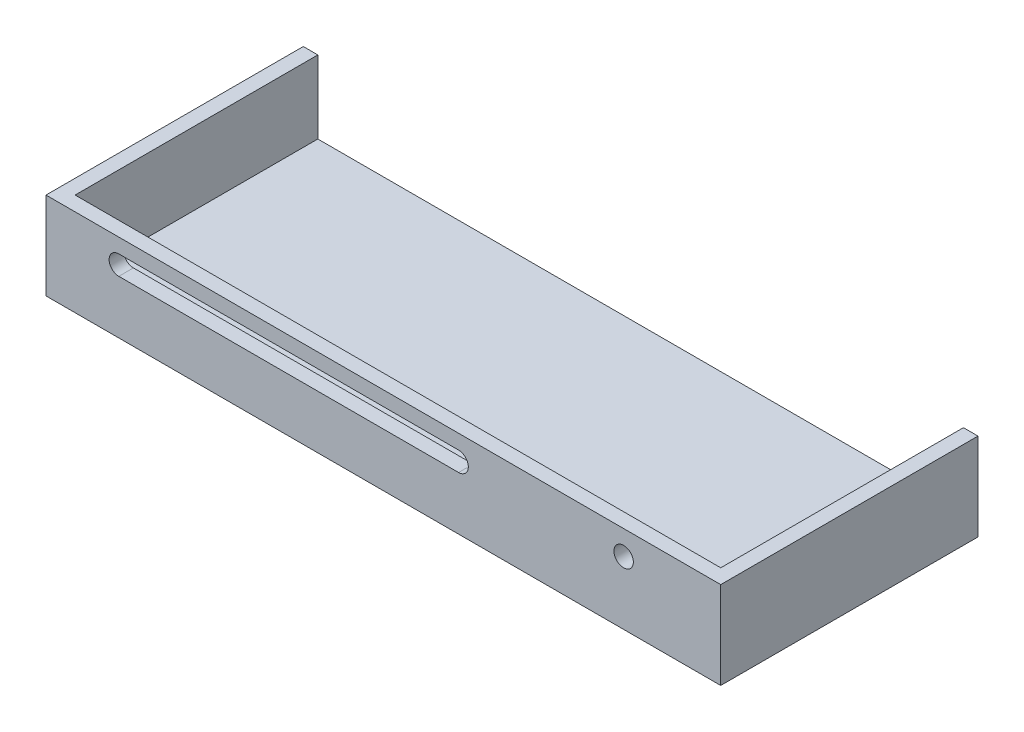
ISO-10303-21;
HEADER;
FILE_DESCRIPTION(('STEP AP214'),'2;1');
FILE_NAME('part.step','',(''),(''),'','','');
FILE_SCHEMA(('AUTOMOTIVE_DESIGN { 1 0 10303 214 1 1 1 1 }'));
ENDSEC;
DATA;
#1=APPLICATION_CONTEXT('core data for automotive mechanical design processes');
#2=APPLICATION_PROTOCOL_DEFINITION('international standard','automotive_design',2000,#1);
#3=PRODUCT_CONTEXT('',#1,'mechanical');
#4=PRODUCT('Part','Part','',(#3));
#5=PRODUCT_RELATED_PRODUCT_CATEGORY('part','',(#4));
#6=PRODUCT_DEFINITION_FORMATION('','',#4);
#7=PRODUCT_DEFINITION_CONTEXT('part definition',#1,'design');
#8=PRODUCT_DEFINITION('design','',#6,#7);
#9=PRODUCT_DEFINITION_SHAPE('','',#8);
#10=(LENGTH_UNIT() NAMED_UNIT(*) SI_UNIT(.MILLI.,.METRE.));
#11=(NAMED_UNIT(*) PLANE_ANGLE_UNIT() SI_UNIT($,.RADIAN.));
#12=(NAMED_UNIT(*) SI_UNIT($,.STERADIAN.) SOLID_ANGLE_UNIT());
#13=UNCERTAINTY_MEASURE_WITH_UNIT(LENGTH_MEASURE(1.E-05),#10,'distance_accuracy_value','');
#14=(GEOMETRIC_REPRESENTATION_CONTEXT(3) GLOBAL_UNCERTAINTY_ASSIGNED_CONTEXT((#13)) GLOBAL_UNIT_ASSIGNED_CONTEXT((#10,
#11,#12)) REPRESENTATION_CONTEXT('',''));
#15=CARTESIAN_POINT('',(0.,0.,0.));
#16=DIRECTION('',(0.,0.,1.));
#17=DIRECTION('',(1.,0.,0.));
#18=AXIS2_PLACEMENT_3D('',#15,#16,#17);
#19=CARTESIAN_POINT('',(139.,-3.,-15.1919082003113));
#20=DIRECTION('',(0.,0.,1.));
#21=DIRECTION('',(1.,0.,0.));
#22=AXIS2_PLACEMENT_3D('',#19,#20,#21);
#23=PLANE('',#22);
#24=DIRECTION('',(1.,0.,0.));
#25=VECTOR('',#24,1.);
#26=CARTESIAN_POINT('',(0.,17.,-15.1919082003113));
#27=LINE('',#26,#25);
#28=CARTESIAN_POINT('',(0.,17.,-15.1919082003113));
#29=VERTEX_POINT('',#28);
#30=CARTESIAN_POINT('',(139.,17.,-15.1919082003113));
#31=VERTEX_POINT('',#30);
#32=EDGE_CURVE('E136',#29,#31,#27,.T.);
#33=ORIENTED_EDGE('',*,*,#32,.F.);
#34=DIRECTION('',(0.,1.,0.));
#35=VECTOR('',#34,1.);
#36=CARTESIAN_POINT('',(0.,-3.,-15.1919082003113));
#37=LINE('',#36,#35);
#38=CARTESIAN_POINT('',(0.,35.,-15.1919082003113));
#39=VERTEX_POINT('',#38);
#40=EDGE_CURVE('E147',#29,#39,#37,.T.);
#41=ORIENTED_EDGE('',*,*,#40,.T.);
#42=DIRECTION('',(1.,0.,0.));
#43=VECTOR('',#42,1.);
#44=CARTESIAN_POINT('',(0.,35.,-15.1919082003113));
#45=LINE('',#44,#43);
#46=CARTESIAN_POINT('',(3.,35.,-15.1919082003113));
#47=VERTEX_POINT('',#46);
#48=EDGE_CURVE('E248',#39,#47,#45,.T.);
#49=ORIENTED_EDGE('',*,*,#48,.T.);
#50=DIRECTION('',(0.,-1.,0.));
#51=VECTOR('',#50,1.);
#52=CARTESIAN_POINT('',(3.,70.1283361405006,-15.1919082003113));
#53=LINE('',#52,#51);
#54=CARTESIAN_POINT('',(3.,20.,-15.1919082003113));
#55=VERTEX_POINT('',#54);
#56=EDGE_CURVE('E247',#47,#55,#53,.T.);
#57=ORIENTED_EDGE('',*,*,#56,.T.);
#58=DIRECTION('',(-1.,0.,0.));
#59=VECTOR('',#58,1.);
#60=CARTESIAN_POINT('',(3.,20.,-15.1919082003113));
#61=LINE('',#60,#59);
#62=CARTESIAN_POINT('',(136.,20.,-15.1919082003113));
#63=VERTEX_POINT('',#62);
#64=EDGE_CURVE('E259',#63,#55,#61,.T.);
#65=ORIENTED_EDGE('',*,*,#64,.F.);
#66=DIRECTION('',(0.,-1.,0.));
#67=VECTOR('',#66,1.);
#68=CARTESIAN_POINT('',(136.,70.1283361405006,-15.1919082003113));
#69=LINE('',#68,#67);
#70=CARTESIAN_POINT('',(136.,35.,-15.1919082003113));
#71=VERTEX_POINT('',#70);
#72=EDGE_CURVE('E240',#71,#63,#69,.T.);
#73=ORIENTED_EDGE('',*,*,#72,.F.);
#74=DIRECTION('',(1.,0.,0.));
#75=VECTOR('',#74,1.);
#76=CARTESIAN_POINT('',(139.,35.,-15.1919082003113));
#77=LINE('',#76,#75);
#78=CARTESIAN_POINT('',(139.,35.,-15.1919082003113));
#79=VERTEX_POINT('',#78);
#80=EDGE_CURVE('E241',#71,#79,#77,.T.);
#81=ORIENTED_EDGE('',*,*,#80,.T.);
#82=DIRECTION('',(0.,1.,0.));
#83=VECTOR('',#82,1.);
#84=CARTESIAN_POINT('',(139.,-3.,-15.1919082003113));
#85=LINE('',#84,#83);
#86=EDGE_CURVE('E150',#31,#79,#85,.T.);
#87=ORIENTED_EDGE('',*,*,#86,.F.);
#88=EDGE_LOOP('',(#33,#41,#49,#57,#65,#73,#81,#87));
#89=FACE_BOUND('',#88,.T.);
#90=ADVANCED_FACE('F45',(#89),#23,.F.);
#91=CARTESIAN_POINT('',(139.,0.,37.8080917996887));
#92=DIRECTION('',(0.,0.,-1.));
#93=DIRECTION('',(-1.,0.,0.));
#94=AXIS2_PLACEMENT_3D('',#91,#92,#93);
#95=PLANE('',#94);
#96=DIRECTION('',(1.,0.,0.));
#97=VECTOR('',#96,1.);
#98=CARTESIAN_POINT('',(85.,32.,37.8080917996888));
#99=LINE('',#98,#97);
#100=CARTESIAN_POINT('',(15.,32.,37.8080917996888));
#101=VERTEX_POINT('',#100);
#102=CARTESIAN_POINT('',(85.,32.,37.8080917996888));
#103=VERTEX_POINT('',#102);
#104=EDGE_CURVE('E214',#101,#103,#99,.T.);
#105=ORIENTED_EDGE('',*,*,#104,.T.);
#106=CARTESIAN_POINT('',(85.,30.,37.8080917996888));
#107=DIRECTION('',(0.,0.,-1.));
#108=DIRECTION('',(0.,1.,0.));
#109=AXIS2_PLACEMENT_3D('',#106,#107,#108);
#110=CIRCLE('',#109,2.);
#111=CARTESIAN_POINT('',(85.,28.,37.8080917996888));
#112=VERTEX_POINT('',#111);
#113=EDGE_CURVE('E202',#103,#112,#110,.T.);
#114=ORIENTED_EDGE('',*,*,#113,.T.);
#115=DIRECTION('',(-1.,0.,0.));
#116=VECTOR('',#115,1.);
#117=CARTESIAN_POINT('',(85.,28.,37.8080917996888));
#118=LINE('',#117,#116);
#119=CARTESIAN_POINT('',(15.,28.,37.8080917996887));
#120=VERTEX_POINT('',#119);
#121=EDGE_CURVE('E206',#112,#120,#118,.T.);
#122=ORIENTED_EDGE('',*,*,#121,.T.);
#123=CARTESIAN_POINT('',(15.,30.,37.8080917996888));
#124=DIRECTION('',(0.,0.,-1.));
#125=DIRECTION('',(0.,1.,0.));
#126=AXIS2_PLACEMENT_3D('',#123,#124,#125);
#127=CIRCLE('',#126,2.);
#128=EDGE_CURVE('E210',#120,#101,#127,.T.);
#129=ORIENTED_EDGE('',*,*,#128,.T.);
#130=EDGE_LOOP('',(#105,#114,#122,#129));
#131=FACE_BOUND('',#130,.T.);
#132=CARTESIAN_POINT('',(119.,30.,37.8080917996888));
#133=DIRECTION('',(0.,0.,-1.));
#134=DIRECTION('',(0.,1.,0.));
#135=AXIS2_PLACEMENT_3D('',#132,#133,#134);
#136=CIRCLE('',#135,2.);
#137=CARTESIAN_POINT('',(119.,32.,37.8080917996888));
#138=VERTEX_POINT('',#137);
#139=EDGE_CURVE('E201',#138,#138,#136,.T.);
#140=ORIENTED_EDGE('',*,*,#139,.T.);
#141=EDGE_LOOP('',(#140));
#142=FACE_BOUND('',#141,.T.);
#143=DIRECTION('',(-1.,0.,0.));
#144=VECTOR('',#143,1.);
#145=CARTESIAN_POINT('',(0.,17.,37.8080917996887));
#146=LINE('',#145,#144);
#147=CARTESIAN_POINT('',(139.,17.,37.8080917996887));
#148=VERTEX_POINT('',#147);
#149=CARTESIAN_POINT('',(0.,17.,37.8080917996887));
#150=VERTEX_POINT('',#149);
#151=EDGE_CURVE('E60',#148,#150,#146,.T.);
#152=ORIENTED_EDGE('',*,*,#151,.F.);
#153=DIRECTION('',(0.,-1.,0.));
#154=VECTOR('',#153,1.);
#155=CARTESIAN_POINT('',(139.,0.,37.8080917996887));
#156=LINE('',#155,#154);
#157=CARTESIAN_POINT('',(139.,35.,37.8080917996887));
#158=VERTEX_POINT('',#157);
#159=EDGE_CURVE('E172',#158,#148,#156,.T.);
#160=ORIENTED_EDGE('',*,*,#159,.F.);
#161=DIRECTION('',(-1.,0.,0.));
#162=VECTOR('',#161,1.);
#163=CARTESIAN_POINT('',(139.,35.,37.8080917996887));
#164=LINE('',#163,#162);
#165=CARTESIAN_POINT('',(0.,35.,37.8080917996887));
#166=VERTEX_POINT('',#165);
#167=EDGE_CURVE('E53',#158,#166,#164,.T.);
#168=ORIENTED_EDGE('',*,*,#167,.T.);
#169=DIRECTION('',(0.,-1.,0.));
#170=VECTOR('',#169,1.);
#171=CARTESIAN_POINT('',(0.,0.,37.8080917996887));
#172=LINE('',#171,#170);
#173=EDGE_CURVE('E162',#166,#150,#172,.T.);
#174=ORIENTED_EDGE('',*,*,#173,.T.);
#175=EDGE_LOOP('',(#152,#160,#168,#174));
#176=FACE_BOUND('',#175,.T.);
#177=ADVANCED_FACE('F279',(#131,#142,#176),#95,.F.);
#178=CARTESIAN_POINT('',(139.,0.,0.));
#179=DIRECTION('',(-1.,0.,0.));
#180=DIRECTION('',(0.,0.,1.));
#181=AXIS2_PLACEMENT_3D('',#178,#179,#180);
#182=PLANE('',#181);
#183=DIRECTION('',(0.,0.,1.));
#184=VECTOR('',#183,1.);
#185=CARTESIAN_POINT('',(139.,17.,37.8080917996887));
#186=LINE('',#185,#184);
#187=EDGE_CURVE('E152',#31,#148,#186,.T.);
#188=ORIENTED_EDGE('',*,*,#187,.F.);
#189=ORIENTED_EDGE('',*,*,#86,.T.);
#190=DIRECTION('',(0.,0.,1.));
#191=VECTOR('',#190,1.);
#192=CARTESIAN_POINT('',(139.,35.,22.8080917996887));
#193=LINE('',#192,#191);
#194=EDGE_CURVE('E168',#79,#158,#193,.T.);
#195=ORIENTED_EDGE('',*,*,#194,.T.);
#196=ORIENTED_EDGE('',*,*,#159,.T.);
#197=EDGE_LOOP('',(#188,#189,#195,#196));
#198=FACE_BOUND('',#197,.T.);
#199=ADVANCED_FACE('F280',(#198),#182,.F.);
#200=CARTESIAN_POINT('',(0.,0.,0.));
#201=DIRECTION('',(-1.,0.,0.));
#202=DIRECTION('',(0.,0.,1.));
#203=AXIS2_PLACEMENT_3D('',#200,#201,#202);
#204=PLANE('',#203);
#205=ORIENTED_EDGE('',*,*,#40,.F.);
#206=DIRECTION('',(0.,0.,-1.));
#207=VECTOR('',#206,1.);
#208=CARTESIAN_POINT('',(0.,17.,37.8080917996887));
#209=LINE('',#208,#207);
#210=EDGE_CURVE('E133',#150,#29,#209,.T.);
#211=ORIENTED_EDGE('',*,*,#210,.F.);
#212=ORIENTED_EDGE('',*,*,#173,.F.);
#213=DIRECTION('',(0.,0.,1.));
#214=VECTOR('',#213,1.);
#215=CARTESIAN_POINT('',(0.,35.,37.8080917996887));
#216=LINE('',#215,#214);
#217=EDGE_CURVE('E155',#39,#166,#216,.T.);
#218=ORIENTED_EDGE('',*,*,#217,.F.);
#219=EDGE_LOOP('',(#205,#211,#212,#218));
#220=FACE_BOUND('',#219,.T.);
#221=ADVANCED_FACE('F154',(#220),#204,.T.);
#222=CARTESIAN_POINT('',(139.,35.,34.8080917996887));
#223=DIRECTION('',(0.,0.,1.));
#224=DIRECTION('',(0.,-1.,0.));
#225=AXIS2_PLACEMENT_3D('',#222,#223,#224);
#226=PLANE('',#225);
#227=DIRECTION('',(1.,0.,0.));
#228=VECTOR('',#227,1.);
#229=CARTESIAN_POINT('',(139.,28.,34.8080917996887));
#230=LINE('',#229,#228);
#231=CARTESIAN_POINT('',(15.,28.,34.8080917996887));
#232=VERTEX_POINT('',#231);
#233=CARTESIAN_POINT('',(85.,28.,34.8080917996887));
#234=VERTEX_POINT('',#233);
#235=EDGE_CURVE('E197',#232,#234,#230,.T.);
#236=ORIENTED_EDGE('',*,*,#235,.T.);
#237=CARTESIAN_POINT('',(85.,30.,34.8080917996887));
#238=DIRECTION('',(0.,0.,1.));
#239=DIRECTION('',(0.,-1.,0.));
#240=AXIS2_PLACEMENT_3D('',#237,#238,#239);
#241=CIRCLE('',#240,2.);
#242=CARTESIAN_POINT('',(85.,32.,34.8080917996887));
#243=VERTEX_POINT('',#242);
#244=EDGE_CURVE('E165',#234,#243,#241,.T.);
#245=ORIENTED_EDGE('',*,*,#244,.T.);
#246=DIRECTION('',(-1.,0.,0.));
#247=VECTOR('',#246,1.);
#248=CARTESIAN_POINT('',(139.,32.,34.8080917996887));
#249=LINE('',#248,#247);
#250=CARTESIAN_POINT('',(15.,32.,34.8080917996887));
#251=VERTEX_POINT('',#250);
#252=EDGE_CURVE('E189',#243,#251,#249,.T.);
#253=ORIENTED_EDGE('',*,*,#252,.T.);
#254=CARTESIAN_POINT('',(15.,30.,34.8080917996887));
#255=DIRECTION('',(0.,0.,1.));
#256=DIRECTION('',(0.,-1.,0.));
#257=AXIS2_PLACEMENT_3D('',#254,#255,#256);
#258=CIRCLE('',#257,2.);
#259=EDGE_CURVE('E193',#251,#232,#258,.T.);
#260=ORIENTED_EDGE('',*,*,#259,.T.);
#261=EDGE_LOOP('',(#236,#245,#253,#260));
#262=FACE_BOUND('',#261,.T.);
#263=CARTESIAN_POINT('',(119.,30.,34.8080917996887));
#264=DIRECTION('',(0.,0.,1.));
#265=DIRECTION('',(0.,-1.,0.));
#266=AXIS2_PLACEMENT_3D('',#263,#264,#265);
#267=CIRCLE('',#266,2.);
#268=CARTESIAN_POINT('',(119.,28.,34.8080917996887));
#269=VERTEX_POINT('',#268);
#270=EDGE_CURVE('E158',#269,#269,#267,.T.);
#271=ORIENTED_EDGE('',*,*,#270,.T.);
#272=EDGE_LOOP('',(#271));
#273=FACE_BOUND('',#272,.T.);
#274=DIRECTION('',(1.,0.,0.));
#275=VECTOR('',#274,1.);
#276=CARTESIAN_POINT('',(3.,20.,34.8080917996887));
#277=LINE('',#276,#275);
#278=CARTESIAN_POINT('',(3.,20.,34.8080917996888));
#279=VERTEX_POINT('',#278);
#280=CARTESIAN_POINT('',(136.,20.,34.8080917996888));
#281=VERTEX_POINT('',#280);
#282=EDGE_CURVE('E270',#279,#281,#277,.T.);
#283=ORIENTED_EDGE('',*,*,#282,.F.);
#284=DIRECTION('',(0.,1.,0.));
#285=VECTOR('',#284,1.);
#286=CARTESIAN_POINT('',(3.,0.,34.8080917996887));
#287=LINE('',#286,#285);
#288=CARTESIAN_POINT('',(3.,35.,34.8080917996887));
#289=VERTEX_POINT('',#288);
#290=EDGE_CURVE('E256',#279,#289,#287,.T.);
#291=ORIENTED_EDGE('',*,*,#290,.T.);
#292=DIRECTION('',(-1.,0.,0.));
#293=VECTOR('',#292,1.);
#294=CARTESIAN_POINT('',(139.,35.,34.8080917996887));
#295=LINE('',#294,#293);
#296=CARTESIAN_POINT('',(136.,35.,34.8080917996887));
#297=VERTEX_POINT('',#296);
#298=EDGE_CURVE('E11',#297,#289,#295,.T.);
#299=ORIENTED_EDGE('',*,*,#298,.F.);
#300=DIRECTION('',(0.,-1.,0.));
#301=VECTOR('',#300,1.);
#302=CARTESIAN_POINT('',(136.,0.,34.8080917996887));
#303=LINE('',#302,#301);
#304=EDGE_CURVE('E244',#297,#281,#303,.T.);
#305=ORIENTED_EDGE('',*,*,#304,.T.);
#306=EDGE_LOOP('',(#283,#291,#299,#305));
#307=FACE_BOUND('',#306,.T.);
#308=ADVANCED_FACE('F287',(#262,#273,#307),#226,.F.);
#309=CARTESIAN_POINT('',(3.,70.1283361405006,19.8080917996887));
#310=DIRECTION('',(-1.,0.,0.));
#311=DIRECTION('',(0.,0.,1.));
#312=AXIS2_PLACEMENT_3D('',#309,#310,#311);
#313=PLANE('',#312);
#314=DIRECTION('',(0.,0.,1.));
#315=VECTOR('',#314,1.);
#316=CARTESIAN_POINT('',(3.,20.,34.8080917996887));
#317=LINE('',#316,#315);
#318=EDGE_CURVE('E68',#55,#279,#317,.T.);
#319=ORIENTED_EDGE('',*,*,#318,.F.);
#320=ORIENTED_EDGE('',*,*,#56,.F.);
#321=DIRECTION('',(0.,0.,1.));
#322=VECTOR('',#321,1.);
#323=CARTESIAN_POINT('',(3.,35.,19.8080917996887));
#324=LINE('',#323,#322);
#325=EDGE_CURVE('E224',#47,#289,#324,.T.);
#326=ORIENTED_EDGE('',*,*,#325,.T.);
#327=ORIENTED_EDGE('',*,*,#290,.F.);
#328=EDGE_LOOP('',(#319,#320,#326,#327));
#329=FACE_BOUND('',#328,.T.);
#330=ADVANCED_FACE('F338',(#329),#313,.F.);
#331=CARTESIAN_POINT('',(136.,70.1283361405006,19.8080917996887));
#332=DIRECTION('',(1.,0.,0.));
#333=DIRECTION('',(0.,0.,-1.));
#334=AXIS2_PLACEMENT_3D('',#331,#332,#333);
#335=PLANE('',#334);
#336=DIRECTION('',(0.,0.,-1.));
#337=VECTOR('',#336,1.);
#338=CARTESIAN_POINT('',(136.,20.,34.8080917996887));
#339=LINE('',#338,#337);
#340=EDGE_CURVE('E266',#281,#63,#339,.T.);
#341=ORIENTED_EDGE('',*,*,#340,.F.);
#342=ORIENTED_EDGE('',*,*,#304,.F.);
#343=DIRECTION('',(0.,0.,-1.));
#344=VECTOR('',#343,1.);
#345=CARTESIAN_POINT('',(136.,35.,19.8080917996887));
#346=LINE('',#345,#344);
#347=EDGE_CURVE('E237',#297,#71,#346,.T.);
#348=ORIENTED_EDGE('',*,*,#347,.T.);
#349=ORIENTED_EDGE('',*,*,#72,.T.);
#350=EDGE_LOOP('',(#341,#342,#348,#349));
#351=FACE_BOUND('',#350,.T.);
#352=ADVANCED_FACE('F349',(#351),#335,.F.);
#353=CARTESIAN_POINT('',(139.,35.,37.8080917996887));
#354=DIRECTION('',(0.,-1.,0.));
#355=DIRECTION('',(0.,0.,-1.));
#356=AXIS2_PLACEMENT_3D('',#353,#354,#355);
#357=PLANE('',#356);
#358=ORIENTED_EDGE('',*,*,#217,.T.);
#359=ORIENTED_EDGE('',*,*,#167,.F.);
#360=ORIENTED_EDGE('',*,*,#194,.F.);
#361=ORIENTED_EDGE('',*,*,#80,.F.);
#362=ORIENTED_EDGE('',*,*,#347,.F.);
#363=ORIENTED_EDGE('',*,*,#298,.T.);
#364=ORIENTED_EDGE('',*,*,#325,.F.);
#365=ORIENTED_EDGE('',*,*,#48,.F.);
#366=EDGE_LOOP('',(#358,#359,#360,#361,#362,#363,#364,#365));
#367=FACE_BOUND('',#366,.T.);
#368=ADVANCED_FACE('F358',(#367),#357,.F.);
#369=CARTESIAN_POINT('',(85.,28.,37.8080917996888));
#370=DIRECTION('',(0.,-1.,0.));
#371=DIRECTION('',(0.,0.,-1.));
#372=AXIS2_PLACEMENT_3D('',#369,#370,#371);
#373=PLANE('',#372);
#374=DIRECTION('',(0.,0.,-1.));
#375=VECTOR('',#374,1.);
#376=CARTESIAN_POINT('',(15.,28.,37.8080917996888));
#377=LINE('',#376,#375);
#378=EDGE_CURVE('E228',#120,#232,#377,.T.);
#379=ORIENTED_EDGE('',*,*,#378,.F.);
#380=ORIENTED_EDGE('',*,*,#121,.F.);
#381=DIRECTION('',(0.,0.,-1.));
#382=VECTOR('',#381,1.);
#383=CARTESIAN_POINT('',(85.,28.,37.8080917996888));
#384=LINE('',#383,#382);
#385=EDGE_CURVE('E218',#112,#234,#384,.T.);
#386=ORIENTED_EDGE('',*,*,#385,.T.);
#387=ORIENTED_EDGE('',*,*,#235,.F.);
#388=EDGE_LOOP('',(#379,#380,#386,#387));
#389=FACE_BOUND('',#388,.T.);
#390=ADVANCED_FACE('F397',(#389),#373,.F.);
#391=CARTESIAN_POINT('',(15.,30.,37.8080917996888));
#392=DIRECTION('',(0.,0.,-1.));
#393=DIRECTION('',(0.,1.,0.));
#394=AXIS2_PLACEMENT_3D('',#391,#392,#393);
#395=CYLINDRICAL_SURFACE('',#394,2.);
#396=DIRECTION('',(0.,0.,-1.));
#397=VECTOR('',#396,1.);
#398=CARTESIAN_POINT('',(15.,32.,37.8080917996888));
#399=LINE('',#398,#397);
#400=EDGE_CURVE('E223',#101,#251,#399,.T.);
#401=ORIENTED_EDGE('',*,*,#400,.F.);
#402=ORIENTED_EDGE('',*,*,#128,.F.);
#403=ORIENTED_EDGE('',*,*,#378,.T.);
#404=ORIENTED_EDGE('',*,*,#259,.F.);
#405=EDGE_LOOP('',(#401,#402,#403,#404));
#406=FACE_BOUND('',#405,.T.);
#407=ADVANCED_FACE('F389',(#406),#395,.F.);
#408=CARTESIAN_POINT('',(85.,32.,37.8080917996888));
#409=DIRECTION('',(0.,1.,0.));
#410=DIRECTION('',(0.,0.,1.));
#411=AXIS2_PLACEMENT_3D('',#408,#409,#410);
#412=PLANE('',#411);
#413=DIRECTION('',(0.,0.,-1.));
#414=VECTOR('',#413,1.);
#415=CARTESIAN_POINT('',(85.,32.,37.8080917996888));
#416=LINE('',#415,#414);
#417=EDGE_CURVE('E219',#103,#243,#416,.T.);
#418=ORIENTED_EDGE('',*,*,#417,.F.);
#419=ORIENTED_EDGE('',*,*,#104,.F.);
#420=ORIENTED_EDGE('',*,*,#400,.T.);
#421=ORIENTED_EDGE('',*,*,#252,.F.);
#422=EDGE_LOOP('',(#418,#419,#420,#421));
#423=FACE_BOUND('',#422,.T.);
#424=ADVANCED_FACE('F380',(#423),#412,.F.);
#425=CARTESIAN_POINT('',(85.,30.,37.8080917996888));
#426=DIRECTION('',(0.,0.,-1.));
#427=DIRECTION('',(0.,1.,0.));
#428=AXIS2_PLACEMENT_3D('',#425,#426,#427);
#429=CYLINDRICAL_SURFACE('',#428,2.);
#430=ORIENTED_EDGE('',*,*,#385,.F.);
#431=ORIENTED_EDGE('',*,*,#113,.F.);
#432=ORIENTED_EDGE('',*,*,#417,.T.);
#433=ORIENTED_EDGE('',*,*,#244,.F.);
#434=EDGE_LOOP('',(#430,#431,#432,#433));
#435=FACE_BOUND('',#434,.T.);
#436=ADVANCED_FACE('F370',(#435),#429,.F.);
#437=CARTESIAN_POINT('',(119.,30.,37.8080917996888));
#438=DIRECTION('',(0.,0.,-1.));
#439=DIRECTION('',(0.,1.,0.));
#440=AXIS2_PLACEMENT_3D('',#437,#438,#439);
#441=CYLINDRICAL_SURFACE('',#440,2.);
#442=ORIENTED_EDGE('',*,*,#139,.F.);
#443=EDGE_LOOP('',(#442));
#444=FACE_BOUND('',#443,.T.);
#445=ORIENTED_EDGE('',*,*,#270,.F.);
#446=EDGE_LOOP('',(#445));
#447=FACE_BOUND('',#446,.T.);
#448=ADVANCED_FACE('F328',(#444,#447),#441,.F.);
#449=CARTESIAN_POINT('',(0.,20.,0.));
#450=DIRECTION('',(0.,-1.,0.));
#451=DIRECTION('',(0.,0.,-1.));
#452=AXIS2_PLACEMENT_3D('',#449,#450,#451);
#453=PLANE('',#452);
#454=ORIENTED_EDGE('',*,*,#318,.T.);
#455=ORIENTED_EDGE('',*,*,#282,.T.);
#456=ORIENTED_EDGE('',*,*,#340,.T.);
#457=ORIENTED_EDGE('',*,*,#64,.T.);
#458=EDGE_LOOP('',(#454,#455,#456,#457));
#459=FACE_BOUND('',#458,.T.);
#460=ADVANCED_FACE('F300',(#459),#453,.F.);
#461=CARTESIAN_POINT('',(0.,17.,0.));
#462=DIRECTION('',(0.,-1.,0.));
#463=DIRECTION('',(0.,0.,-1.));
#464=AXIS2_PLACEMENT_3D('',#461,#462,#463);
#465=PLANE('',#464);
#466=ORIENTED_EDGE('',*,*,#210,.T.);
#467=ORIENTED_EDGE('',*,*,#32,.T.);
#468=ORIENTED_EDGE('',*,*,#187,.T.);
#469=ORIENTED_EDGE('',*,*,#151,.T.);
#470=EDGE_LOOP('',(#466,#467,#468,#469));
#471=FACE_BOUND('',#470,.T.);
#472=ADVANCED_FACE('F135',(#471),#465,.T.);
#473=CLOSED_SHELL('',(#90,#177,#199,#221,#308,#330,#352,#368,#390,#407,#424,#436,#448,#460,#472));
#474=MANIFOLD_SOLID_BREP('B2',#473);
#475=ADVANCED_BREP_SHAPE_REPRESENTATION('',(#18,#474),#14);
#476=SHAPE_DEFINITION_REPRESENTATION(#9,#475);
ENDSEC;
END-ISO-10303-21;
